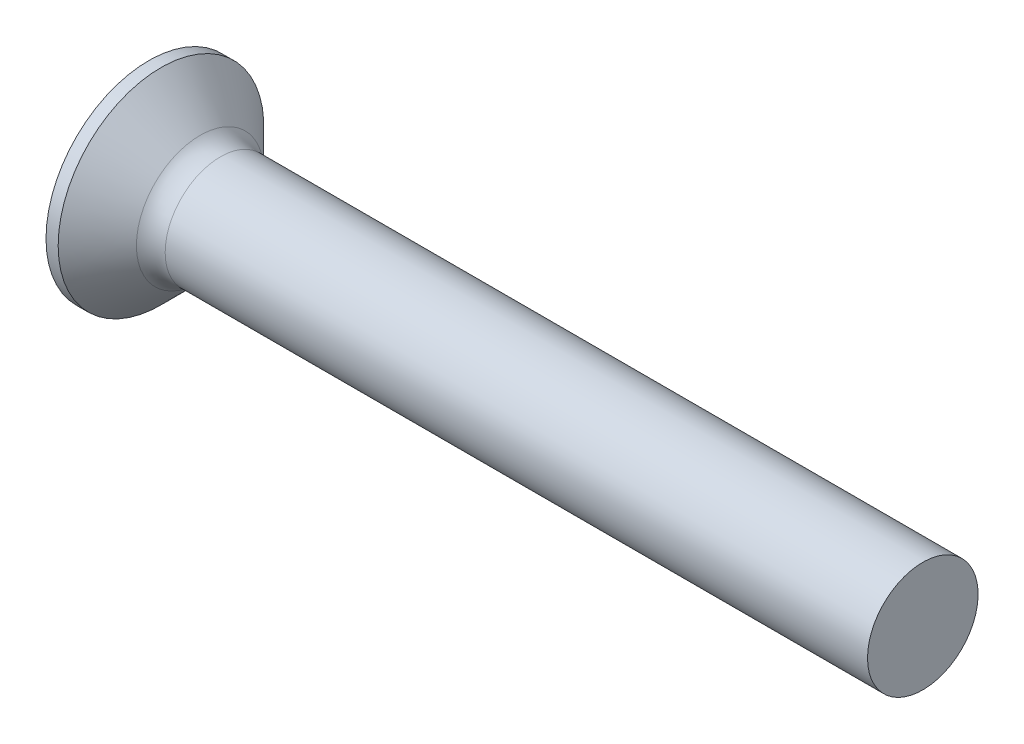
ISO-10303-21;
HEADER;
FILE_DESCRIPTION(('STEP AP214'),'2;1');
FILE_NAME('part.step','',(''),(''),'','','');
FILE_SCHEMA(('AUTOMOTIVE_DESIGN { 1 0 10303 214 1 1 1 1 }'));
ENDSEC;
DATA;
#1=APPLICATION_CONTEXT('core data for automotive mechanical design processes');
#2=APPLICATION_PROTOCOL_DEFINITION('international standard','automotive_design',2000,#1);
#3=PRODUCT_CONTEXT('',#1,'mechanical');
#4=PRODUCT('Part','Part','',(#3));
#5=PRODUCT_RELATED_PRODUCT_CATEGORY('part','',(#4));
#6=PRODUCT_DEFINITION_FORMATION('','',#4);
#7=PRODUCT_DEFINITION_CONTEXT('part definition',#1,'design');
#8=PRODUCT_DEFINITION('design','',#6,#7);
#9=PRODUCT_DEFINITION_SHAPE('','',#8);
#10=(LENGTH_UNIT() NAMED_UNIT(*) SI_UNIT(.MILLI.,.METRE.));
#11=(NAMED_UNIT(*) PLANE_ANGLE_UNIT() SI_UNIT($,.RADIAN.));
#12=(NAMED_UNIT(*) SI_UNIT($,.STERADIAN.) SOLID_ANGLE_UNIT());
#13=UNCERTAINTY_MEASURE_WITH_UNIT(LENGTH_MEASURE(1.E-05),#10,'distance_accuracy_value','');
#14=(GEOMETRIC_REPRESENTATION_CONTEXT(3) GLOBAL_UNCERTAINTY_ASSIGNED_CONTEXT((#13)) GLOBAL_UNIT_ASSIGNED_CONTEXT((#10,
#11,#12)) REPRESENTATION_CONTEXT('',''));
#15=CARTESIAN_POINT('',(0.,0.,0.));
#16=DIRECTION('',(0.,0.,1.));
#17=DIRECTION('',(1.,0.,0.));
#18=AXIS2_PLACEMENT_3D('',#15,#16,#17);
#19=CARTESIAN_POINT('',(3.05,-0.929326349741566,0.515));
#20=DIRECTION('',(0.,0.,-1.));
#21=DIRECTION('',(0.,1.,0.));
#22=AXIS2_PLACEMENT_3D('',#19,#20,#21);
#23=PLANE('',#22);
#24=DIRECTION('',(0.,-1.,0.));
#25=VECTOR('',#24,1.);
#26=CARTESIAN_POINT('',(0.,2.45,0.515));
#27=LINE('',#26,#25);
#28=CARTESIAN_POINT('',(0.,-0.931375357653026,0.515));
#29=VERTEX_POINT('',#28);
#30=CARTESIAN_POINT('',(0.,-2.45,0.515));
#31=VERTEX_POINT('',#30);
#32=EDGE_CURVE('E313',#29,#31,#27,.T.);
#33=ORIENTED_EDGE('',*,*,#32,.F.);
#34=CARTESIAN_POINT('',(-1.54221347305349,-1.05291860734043,0.515));
#35=CARTESIAN_POINT('',(-1.22007147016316,-1.02783607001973,0.515));
#36=CARTESIAN_POINT('',(-0.89794181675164,-1.002592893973,0.515));
#37=CARTESIAN_POINT('',(-0.253713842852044,-0.951673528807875,0.515));
#38=CARTESIAN_POINT('',(0.0683844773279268,-0.925997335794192,0.515));
#39=CARTESIAN_POINT('',(0.712537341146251,-0.874100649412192,0.515));
#40=CARTESIAN_POINT('',(1.03459188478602,-0.847880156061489,0.515));
#41=CARTESIAN_POINT('',(1.67864013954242,-0.794723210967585,0.515));
#42=CARTESIAN_POINT('',(2.0006338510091,-0.767786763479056,0.515));
#43=CARTESIAN_POINT('',(2.56056239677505,-0.720091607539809,0.515));
#44=CARTESIAN_POINT('',(2.7985160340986,-0.699554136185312,0.515));
#45=CARTESIAN_POINT('',(3.27436149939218,-0.657782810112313,0.515));
#46=CARTESIAN_POINT('',(3.51225332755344,-0.636548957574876,0.515));
#47=CARTESIAN_POINT('',(3.98796007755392,-0.59316517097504,0.515));
#48=CARTESIAN_POINT('',(4.22577499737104,-0.571015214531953,0.515));
#49=CARTESIAN_POINT('',(4.70127802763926,-0.525368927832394,0.515));
#50=CARTESIAN_POINT('',(4.93896613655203,-0.50187258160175,0.515));
#51=CARTESIAN_POINT('',(5.17656597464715,-0.477487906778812,0.515));
#52=B_SPLINE_CURVE_WITH_KNOTS('',3,(#34,#35,#36,#37,#38,#39,#40,#41,#42,#43,#44,#45,#46,#47,#48,
#49,#50,#51),.UNSPECIFIED.,.F.,.F.,(4,2,2,2,2,2,2,2,4),(0.,0.969351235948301,1.93871119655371,
2.90807112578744,3.87742529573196,4.59393929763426,5.3104510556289,6.0269803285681,
6.74351810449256),.UNSPECIFIED.);
#53=CARTESIAN_POINT('',(3.05,-0.677477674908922,0.515));
#54=VERTEX_POINT('',#53);
#55=EDGE_CURVE('E193',#29,#54,#52,.T.);
#56=ORIENTED_EDGE('',*,*,#55,.T.);
#57=DIRECTION('',(0.,-1.,0.));
#58=VECTOR('',#57,1.);
#59=CARTESIAN_POINT('',(3.05,0.929326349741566,0.515));
#60=LINE('',#59,#58);
#61=CARTESIAN_POINT('',(3.05,-0.929326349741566,0.515));
#62=VERTEX_POINT('',#61);
#63=EDGE_CURVE('E337',#54,#62,#60,.T.);
#64=ORIENTED_EDGE('',*,*,#63,.T.);
#65=DIRECTION('',(0.894934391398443,0.446197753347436,0.));
#66=VECTOR('',#65,1.);
#67=CARTESIAN_POINT('',(0.,-2.45,0.515));
#68=LINE('',#67,#66);
#69=EDGE_CURVE('E324',#31,#62,#68,.T.);
#70=ORIENTED_EDGE('',*,*,#69,.F.);
#71=EDGE_LOOP('',(#33,#56,#64,#70));
#72=FACE_BOUND('',#71,.T.);
#73=ADVANCED_FACE('F35',(#72),#23,.T.);
#74=CARTESIAN_POINT('',(3.05,0.929326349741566,0.515));
#75=VERTEX_POINT('',#74);
#76=CARTESIAN_POINT('',(3.05,0.677477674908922,0.515));
#77=VERTEX_POINT('',#76);
#78=EDGE_CURVE('E339',#75,#77,#60,.T.);
#79=ORIENTED_EDGE('',*,*,#78,.T.);
#80=CARTESIAN_POINT('',(-1.54221347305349,1.05291860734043,0.515));
#81=CARTESIAN_POINT('',(-1.22007147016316,1.02783607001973,0.515));
#82=CARTESIAN_POINT('',(-0.89794181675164,1.002592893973,0.515));
#83=CARTESIAN_POINT('',(-0.253713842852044,0.951673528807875,0.515));
#84=CARTESIAN_POINT('',(0.0683844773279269,0.925997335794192,0.515));
#85=CARTESIAN_POINT('',(0.712537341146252,0.874100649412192,0.515));
#86=CARTESIAN_POINT('',(1.03459188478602,0.847880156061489,0.515));
#87=CARTESIAN_POINT('',(1.67864013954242,0.794723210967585,0.515));
#88=CARTESIAN_POINT('',(2.0006338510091,0.767786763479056,0.515));
#89=CARTESIAN_POINT('',(2.56056239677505,0.720091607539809,0.515));
#90=CARTESIAN_POINT('',(2.7985160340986,0.699554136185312,0.515));
#91=CARTESIAN_POINT('',(3.27436149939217,0.657782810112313,0.515));
#92=CARTESIAN_POINT('',(3.51225332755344,0.636548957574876,0.515));
#93=CARTESIAN_POINT('',(3.98796007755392,0.59316517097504,0.515));
#94=CARTESIAN_POINT('',(4.22577499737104,0.571015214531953,0.515));
#95=CARTESIAN_POINT('',(4.70127802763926,0.525368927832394,0.515));
#96=CARTESIAN_POINT('',(4.93896613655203,0.50187258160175,0.515));
#97=CARTESIAN_POINT('',(5.17656597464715,0.477487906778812,0.515));
#98=B_SPLINE_CURVE_WITH_KNOTS('',3,(#80,#81,#82,#83,#84,#85,#86,#87,#88,#89,#90,#91,#92,#93,#94,
#95,#96,#97),.UNSPECIFIED.,.F.,.F.,(4,2,2,2,2,2,2,2,4),(0.,0.969351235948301,1.93871119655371,
2.90807112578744,3.87742529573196,4.59393929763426,5.3104510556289,6.0269803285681,
6.74351810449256),.UNSPECIFIED.);
#99=CARTESIAN_POINT('',(0.,0.931375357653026,0.515));
#100=VERTEX_POINT('',#99);
#101=EDGE_CURVE('E186',#77,#100,#98,.F.);
#102=ORIENTED_EDGE('',*,*,#101,.T.);
#103=CARTESIAN_POINT('',(0.,2.45,0.515));
#104=VERTEX_POINT('',#103);
#105=EDGE_CURVE('E315',#104,#100,#27,.T.);
#106=ORIENTED_EDGE('',*,*,#105,.F.);
#107=DIRECTION('',(0.894934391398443,-0.446197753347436,0.));
#108=VECTOR('',#107,1.);
#109=CARTESIAN_POINT('',(0.,2.45,0.515));
#110=LINE('',#109,#108);
#111=EDGE_CURVE('E64',#104,#75,#110,.T.);
#112=ORIENTED_EDGE('',*,*,#111,.T.);
#113=EDGE_LOOP('',(#79,#102,#106,#112));
#114=FACE_BOUND('',#113,.T.);
#115=ADVANCED_FACE('F168',(#114),#23,.T.);
#116=CARTESIAN_POINT('',(3.05,0.929326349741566,-0.515));
#117=DIRECTION('',(0.,0.,1.));
#118=DIRECTION('',(1.,0.,0.));
#119=AXIS2_PLACEMENT_3D('',#116,#117,#118);
#120=PLANE('',#119);
#121=DIRECTION('',(0.,1.,0.));
#122=VECTOR('',#121,1.);
#123=CARTESIAN_POINT('',(3.05,-0.929326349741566,-0.515));
#124=LINE('',#123,#122);
#125=CARTESIAN_POINT('',(3.05,-0.929326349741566,-0.515));
#126=VERTEX_POINT('',#125);
#127=CARTESIAN_POINT('',(3.05,-0.677477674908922,-0.515));
#128=VERTEX_POINT('',#127);
#129=EDGE_CURVE('E338',#126,#128,#124,.T.);
#130=ORIENTED_EDGE('',*,*,#129,.T.);
#131=CARTESIAN_POINT('',(-1.54221347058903,-1.05291860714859,-0.515));
#132=CARTESIAN_POINT('',(-1.22007146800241,-1.02783606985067,-0.515));
#133=CARTESIAN_POINT('',(-0.897941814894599,-1.00259289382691,-0.515));
#134=CARTESIAN_POINT('',(-0.253713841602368,-0.951673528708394,-0.515));
#135=CARTESIAN_POINT('',(0.0683844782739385,-0.925997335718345,-0.515));
#136=CARTESIAN_POINT('',(0.712537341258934,-0.874100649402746,-0.515));
#137=CARTESIAN_POINT('',(1.03459188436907,-0.847880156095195,-0.515));
#138=CARTESIAN_POINT('',(1.67864013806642,-0.794723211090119,-0.515));
#139=CARTESIAN_POINT('',(2.00063384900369,-0.767786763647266,-0.515));
#140=CARTESIAN_POINT('',(2.56056239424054,-0.720091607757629,-0.515));
#141=CARTESIAN_POINT('',(2.79851603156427,-0.699554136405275,-0.515));
#142=CARTESIAN_POINT('',(3.27436149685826,-0.657782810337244,-0.515));
#143=CARTESIAN_POINT('',(3.51225332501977,-0.636548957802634,-0.515));
#144=CARTESIAN_POINT('',(3.98796007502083,-0.593165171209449,-0.515));
#145=CARTESIAN_POINT('',(4.22577499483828,-0.571015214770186,-0.515));
#146=CARTESIAN_POINT('',(4.70127802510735,-0.525368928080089,-0.515));
#147=CARTESIAN_POINT('',(4.93896613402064,-0.501872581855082,-0.515));
#148=CARTESIAN_POINT('',(5.17656597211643,-0.477487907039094,-0.515));
#149=B_SPLINE_CURVE_WITH_KNOTS('',3,(#131,#132,#133,#134,#135,#136,#137,#138,#139,#140,#141,
#142,#143,#144,#145,#146,#147,#148),.UNSPECIFIED.,.F.,.F.,(4,2,2,2,2,2,2,2,4),(0.,
0.9693512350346,1.93871119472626,2.90807112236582,3.87742529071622,4.59393929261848,
5.3104510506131,6.02698032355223,6.74351809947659),.UNSPECIFIED.);
#150=CARTESIAN_POINT('',(0.,-0.931375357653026,-0.515));
#151=VERTEX_POINT('',#150);
#152=EDGE_CURVE('E239',#128,#151,#149,.F.);
#153=ORIENTED_EDGE('',*,*,#152,.T.);
#154=DIRECTION('',(0.,1.,0.));
#155=VECTOR('',#154,1.);
#156=CARTESIAN_POINT('',(0.,-2.45,-0.515));
#157=LINE('',#156,#155);
#158=CARTESIAN_POINT('',(0.,-2.45,-0.515));
#159=VERTEX_POINT('',#158);
#160=EDGE_CURVE('E314',#159,#151,#157,.T.);
#161=ORIENTED_EDGE('',*,*,#160,.F.);
#162=DIRECTION('',(0.894934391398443,0.446197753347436,0.));
#163=VECTOR('',#162,1.);
#164=CARTESIAN_POINT('',(0.,-2.45,-0.515));
#165=LINE('',#164,#163);
#166=EDGE_CURVE('E327',#159,#126,#165,.T.);
#167=ORIENTED_EDGE('',*,*,#166,.T.);
#168=EDGE_LOOP('',(#130,#153,#161,#167));
#169=FACE_BOUND('',#168,.T.);
#170=ADVANCED_FACE('F174',(#169),#120,.T.);
#171=CARTESIAN_POINT('',(0.,0.931375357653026,-0.515));
#172=VERTEX_POINT('',#171);
#173=CARTESIAN_POINT('',(0.,2.45,-0.515));
#174=VERTEX_POINT('',#173);
#175=EDGE_CURVE('E323',#172,#174,#157,.T.);
#176=ORIENTED_EDGE('',*,*,#175,.F.);
#177=CARTESIAN_POINT('',(-1.54221347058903,1.05291860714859,-0.515));
#178=CARTESIAN_POINT('',(-1.22007146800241,1.02783606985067,-0.515));
#179=CARTESIAN_POINT('',(-0.897941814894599,1.00259289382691,-0.515));
#180=CARTESIAN_POINT('',(-0.253713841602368,0.951673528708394,-0.515));
#181=CARTESIAN_POINT('',(0.0683844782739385,0.925997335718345,-0.515));
#182=CARTESIAN_POINT('',(0.712537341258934,0.874100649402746,-0.515));
#183=CARTESIAN_POINT('',(1.03459188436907,0.847880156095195,-0.515));
#184=CARTESIAN_POINT('',(1.67864013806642,0.794723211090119,-0.515));
#185=CARTESIAN_POINT('',(2.00063384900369,0.767786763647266,-0.515));
#186=CARTESIAN_POINT('',(2.56056239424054,0.720091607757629,-0.515));
#187=CARTESIAN_POINT('',(2.79851603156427,0.699554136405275,-0.515));
#188=CARTESIAN_POINT('',(3.27436149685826,0.657782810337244,-0.515));
#189=CARTESIAN_POINT('',(3.51225332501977,0.636548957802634,-0.515));
#190=CARTESIAN_POINT('',(3.98796007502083,0.593165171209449,-0.515));
#191=CARTESIAN_POINT('',(4.22577499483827,0.571015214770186,-0.515));
#192=CARTESIAN_POINT('',(4.70127802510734,0.525368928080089,-0.515));
#193=CARTESIAN_POINT('',(4.93896613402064,0.501872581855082,-0.515));
#194=CARTESIAN_POINT('',(5.17656597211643,0.477487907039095,-0.515));
#195=B_SPLINE_CURVE_WITH_KNOTS('',3,(#177,#178,#179,#180,#181,#182,#183,#184,#185,#186,#187,
#188,#189,#190,#191,#192,#193,#194),.UNSPECIFIED.,.F.,.F.,(4,2,2,2,2,2,2,2,4),(0.,
0.9693512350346,1.93871119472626,2.90807112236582,3.87742529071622,4.59393929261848,
5.3104510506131,6.02698032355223,6.74351809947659),.UNSPECIFIED.);
#196=CARTESIAN_POINT('',(3.05,0.677477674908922,-0.515));
#197=VERTEX_POINT('',#196);
#198=EDGE_CURVE('E234',#172,#197,#195,.T.);
#199=ORIENTED_EDGE('',*,*,#198,.T.);
#200=CARTESIAN_POINT('',(3.05,0.929326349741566,-0.515));
#201=VERTEX_POINT('',#200);
#202=EDGE_CURVE('E344',#197,#201,#124,.T.);
#203=ORIENTED_EDGE('',*,*,#202,.T.);
#204=DIRECTION('',(0.894934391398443,-0.446197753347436,0.));
#205=VECTOR('',#204,1.);
#206=CARTESIAN_POINT('',(0.,2.45,-0.515));
#207=LINE('',#206,#205);
#208=EDGE_CURVE('E331',#174,#201,#207,.T.);
#209=ORIENTED_EDGE('',*,*,#208,.F.);
#210=EDGE_LOOP('',(#176,#199,#203,#209));
#211=FACE_BOUND('',#210,.T.);
#212=ADVANCED_FACE('F460',(#211),#120,.T.);
#213=CARTESIAN_POINT('',(3.05,0.929326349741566,-0.515));
#214=DIRECTION('',(1.,0.,0.));
#215=DIRECTION('',(0.,0.,-1.));
#216=AXIS2_PLACEMENT_3D('',#213,#214,#215);
#217=PLANE('',#216);
#218=CARTESIAN_POINT('',(3.05,0.,0.));
#219=DIRECTION('',(-1.,0.,0.));
#220=DIRECTION('',(0.,0.,1.));
#221=AXIS2_PLACEMENT_3D('',#218,#219,#220);
#222=CIRCLE('',#221,0.850999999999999);
#223=EDGE_CURVE('E283',#128,#54,#222,.T.);
#224=ORIENTED_EDGE('',*,*,#223,.F.);
#225=ORIENTED_EDGE('',*,*,#129,.F.);
#226=DIRECTION('',(0.,0.,-1.));
#227=VECTOR('',#226,1.);
#228=CARTESIAN_POINT('',(3.05,-0.929326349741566,0.515));
#229=LINE('',#228,#227);
#230=EDGE_CURVE('E334',#62,#126,#229,.T.);
#231=ORIENTED_EDGE('',*,*,#230,.F.);
#232=ORIENTED_EDGE('',*,*,#63,.F.);
#233=EDGE_LOOP('',(#224,#225,#231,#232));
#234=FACE_BOUND('',#233,.T.);
#235=ADVANCED_FACE('F417',(#234),#217,.F.);
#236=CARTESIAN_POINT('',(3.05,-0.515000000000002,0.67747767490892));
#237=VERTEX_POINT('',#236);
#238=CARTESIAN_POINT('',(3.05,0.514999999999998,0.677477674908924));
#239=VERTEX_POINT('',#238);
#240=EDGE_CURVE('E276',#237,#239,#222,.T.);
#241=ORIENTED_EDGE('',*,*,#240,.F.);
#242=DIRECTION('',(0.,0.,-1.));
#243=VECTOR('',#242,1.);
#244=CARTESIAN_POINT('',(3.05,-0.515000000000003,0.929326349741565));
#245=LINE('',#244,#243);
#246=CARTESIAN_POINT('',(3.05,-0.515000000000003,0.929326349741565));
#247=VERTEX_POINT('',#246);
#248=EDGE_CURVE('E402',#247,#237,#245,.T.);
#249=ORIENTED_EDGE('',*,*,#248,.F.);
#250=DIRECTION('',(0.,-1.,0.));
#251=VECTOR('',#250,1.);
#252=CARTESIAN_POINT('',(3.05,0.514999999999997,0.929326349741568));
#253=LINE('',#252,#251);
#254=CARTESIAN_POINT('',(3.05,0.514999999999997,0.929326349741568));
#255=VERTEX_POINT('',#254);
#256=EDGE_CURVE('E302',#255,#247,#253,.T.);
#257=ORIENTED_EDGE('',*,*,#256,.F.);
#258=DIRECTION('',(0.,0.,1.));
#259=VECTOR('',#258,1.);
#260=CARTESIAN_POINT('',(3.05,0.515000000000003,-0.929326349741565));
#261=LINE('',#260,#259);
#262=EDGE_CURVE('E200',#239,#255,#261,.T.);
#263=ORIENTED_EDGE('',*,*,#262,.F.);
#264=EDGE_LOOP('',(#241,#249,#257,#263));
#265=FACE_BOUND('',#264,.T.);
#266=ADVANCED_FACE('F452',(#265),#217,.F.);
#267=EDGE_CURVE('E275',#77,#197,#222,.T.);
#268=ORIENTED_EDGE('',*,*,#267,.F.);
#269=ORIENTED_EDGE('',*,*,#78,.F.);
#270=DIRECTION('',(0.,0.,1.));
#271=VECTOR('',#270,1.);
#272=CARTESIAN_POINT('',(3.05,0.929326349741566,-0.515));
#273=LINE('',#272,#271);
#274=EDGE_CURVE('E335',#201,#75,#273,.T.);
#275=ORIENTED_EDGE('',*,*,#274,.F.);
#276=ORIENTED_EDGE('',*,*,#202,.F.);
#277=EDGE_LOOP('',(#268,#269,#275,#276));
#278=FACE_BOUND('',#277,.T.);
#279=ADVANCED_FACE('F432',(#278),#217,.F.);
#280=CARTESIAN_POINT('',(3.05,0.514999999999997,0.929326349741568));
#281=DIRECTION('',(0.,-1.,0.));
#282=DIRECTION('',(1.,0.,0.));
#283=AXIS2_PLACEMENT_3D('',#280,#281,#282);
#284=PLANE('',#283);
#285=CARTESIAN_POINT('',(3.05,0.515000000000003,-0.929326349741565));
#286=VERTEX_POINT('',#285);
#287=CARTESIAN_POINT('',(3.05,0.515000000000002,-0.67747767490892));
#288=VERTEX_POINT('',#287);
#289=EDGE_CURVE('E297',#286,#288,#261,.T.);
#290=ORIENTED_EDGE('',*,*,#289,.T.);
#291=CARTESIAN_POINT('',(-1.54221347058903,0.515000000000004,-1.05291860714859));
#292=CARTESIAN_POINT('',(-1.22007146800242,0.515000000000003,-1.02783606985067));
#293=CARTESIAN_POINT('',(-0.897941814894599,0.515000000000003,-1.00259289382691));
#294=CARTESIAN_POINT('',(-0.253713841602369,0.515000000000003,-0.951673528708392));
#295=CARTESIAN_POINT('',(0.0683844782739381,0.515000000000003,-0.925997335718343));
#296=CARTESIAN_POINT('',(0.712537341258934,0.515000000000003,-0.874100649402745));
#297=CARTESIAN_POINT('',(1.03459188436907,0.515000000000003,-0.847880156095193));
#298=CARTESIAN_POINT('',(1.67864013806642,0.515000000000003,-0.794723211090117));
#299=CARTESIAN_POINT('',(2.00063384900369,0.515000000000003,-0.767786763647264));
#300=CARTESIAN_POINT('',(2.56056239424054,0.515000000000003,-0.720091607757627));
#301=CARTESIAN_POINT('',(2.79851603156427,0.515000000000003,-0.699554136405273));
#302=CARTESIAN_POINT('',(3.27436149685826,0.515000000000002,-0.657782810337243));
#303=CARTESIAN_POINT('',(3.51225332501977,0.515000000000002,-0.636548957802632));
#304=CARTESIAN_POINT('',(3.98796007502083,0.515000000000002,-0.593165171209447));
#305=CARTESIAN_POINT('',(4.22577499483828,0.515000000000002,-0.571015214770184));
#306=CARTESIAN_POINT('',(4.70127802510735,0.515000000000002,-0.525368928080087));
#307=CARTESIAN_POINT('',(4.93896613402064,0.515000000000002,-0.50187258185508));
#308=CARTESIAN_POINT('',(5.17656597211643,0.515000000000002,-0.477487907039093));
#309=B_SPLINE_CURVE_WITH_KNOTS('',3,(#291,#292,#293,#294,#295,#296,#297,#298,#299,#300,#301,
#302,#303,#304,#305,#306,#307,#308),.UNSPECIFIED.,.F.,.F.,(4,2,2,2,2,2,2,2,4),(0.,
0.969351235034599,1.93871119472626,2.90807112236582,3.87742529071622,4.59393929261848,
5.3104510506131,6.02698032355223,6.74351809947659),.UNSPECIFIED.);
#310=CARTESIAN_POINT('',(0.,0.515000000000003,-0.931375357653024));
#311=VERTEX_POINT('',#310);
#312=EDGE_CURVE('E227',#288,#311,#309,.F.);
#313=ORIENTED_EDGE('',*,*,#312,.T.);
#314=DIRECTION('',(0.,0.,1.));
#315=VECTOR('',#314,1.);
#316=CARTESIAN_POINT('',(0.,0.515000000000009,-2.45));
#317=LINE('',#316,#315);
#318=CARTESIAN_POINT('',(0.,0.515000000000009,-2.45));
#319=VERTEX_POINT('',#318);
#320=EDGE_CURVE('E391',#319,#311,#317,.T.);
#321=ORIENTED_EDGE('',*,*,#320,.F.);
#322=DIRECTION('',(0.894934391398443,0.,0.446197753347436));
#323=VECTOR('',#322,1.);
#324=CARTESIAN_POINT('',(0.,0.515000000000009,-2.45));
#325=LINE('',#324,#323);
#326=EDGE_CURVE('E301',#319,#286,#325,.T.);
#327=ORIENTED_EDGE('',*,*,#326,.T.);
#328=EDGE_LOOP('',(#290,#313,#321,#327));
#329=FACE_BOUND('',#328,.T.);
#330=ADVANCED_FACE('F300',(#329),#284,.T.);
#331=CARTESIAN_POINT('',(3.05,-0.514999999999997,-0.929326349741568));
#332=DIRECTION('',(0.,1.,0.));
#333=DIRECTION('',(0.,0.,1.));
#334=AXIS2_PLACEMENT_3D('',#331,#332,#333);
#335=PLANE('',#334);
#336=DIRECTION('',(0.,0.,-1.));
#337=VECTOR('',#336,1.);
#338=CARTESIAN_POINT('',(0.,-0.515000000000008,2.45));
#339=LINE('',#338,#337);
#340=CARTESIAN_POINT('',(0.,-0.514999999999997,-0.931375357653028));
#341=VERTEX_POINT('',#340);
#342=CARTESIAN_POINT('',(0.,-0.514999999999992,-2.45));
#343=VERTEX_POINT('',#342);
#344=EDGE_CURVE('E387',#341,#343,#339,.T.);
#345=ORIENTED_EDGE('',*,*,#344,.F.);
#346=CARTESIAN_POINT('',(-1.54221347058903,-0.514999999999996,-1.05291860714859));
#347=CARTESIAN_POINT('',(-1.22007146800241,-0.514999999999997,-1.02783606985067));
#348=CARTESIAN_POINT('',(-0.897941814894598,-0.514999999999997,-1.00259289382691));
#349=CARTESIAN_POINT('',(-0.253713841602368,-0.514999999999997,-0.951673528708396));
#350=CARTESIAN_POINT('',(0.0683844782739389,-0.514999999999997,-0.925997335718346));
#351=CARTESIAN_POINT('',(0.712537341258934,-0.514999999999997,-0.874100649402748));
#352=CARTESIAN_POINT('',(1.03459188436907,-0.514999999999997,-0.847880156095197));
#353=CARTESIAN_POINT('',(1.67864013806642,-0.514999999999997,-0.794723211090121));
#354=CARTESIAN_POINT('',(2.00063384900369,-0.514999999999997,-0.767786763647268));
#355=CARTESIAN_POINT('',(2.56056239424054,-0.514999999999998,-0.72009160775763));
#356=CARTESIAN_POINT('',(2.79851603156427,-0.514999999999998,-0.699554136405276));
#357=CARTESIAN_POINT('',(3.27436149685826,-0.514999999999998,-0.657782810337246));
#358=CARTESIAN_POINT('',(3.51225332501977,-0.514999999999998,-0.636548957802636));
#359=CARTESIAN_POINT('',(3.98796007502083,-0.514999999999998,-0.59316517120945));
#360=CARTESIAN_POINT('',(4.22577499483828,-0.514999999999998,-0.571015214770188));
#361=CARTESIAN_POINT('',(4.70127802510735,-0.514999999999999,-0.52536892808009));
#362=CARTESIAN_POINT('',(4.93896613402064,-0.514999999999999,-0.501872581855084));
#363=CARTESIAN_POINT('',(5.17656597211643,-0.514999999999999,-0.477487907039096));
#364=B_SPLINE_CURVE_WITH_KNOTS('',3,(#346,#347,#348,#349,#350,#351,#352,#353,#354,#355,#356,
#357,#358,#359,#360,#361,#362,#363),.UNSPECIFIED.,.F.,.F.,(4,2,2,2,2,2,2,2,4),(0.,
0.969351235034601,1.93871119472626,2.90807112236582,3.87742529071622,4.59393929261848,
5.3104510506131,6.02698032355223,6.74351809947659),.UNSPECIFIED.);
#365=CARTESIAN_POINT('',(3.05,-0.514999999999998,-0.677477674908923));
#366=VERTEX_POINT('',#365);
#367=EDGE_CURVE('E220',#341,#366,#364,.T.);
#368=ORIENTED_EDGE('',*,*,#367,.T.);
#369=CARTESIAN_POINT('',(3.05,-0.514999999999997,-0.929326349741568));
#370=VERTEX_POINT('',#369);
#371=EDGE_CURVE('E299',#366,#370,#245,.T.);
#372=ORIENTED_EDGE('',*,*,#371,.T.);
#373=DIRECTION('',(0.894934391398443,0.,0.446197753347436));
#374=VECTOR('',#373,1.);
#375=CARTESIAN_POINT('',(0.,-0.514999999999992,-2.45));
#376=LINE('',#375,#374);
#377=EDGE_CURVE('E394',#343,#370,#376,.T.);
#378=ORIENTED_EDGE('',*,*,#377,.F.);
#379=EDGE_LOOP('',(#345,#368,#372,#378));
#380=FACE_BOUND('',#379,.T.);
#381=ADVANCED_FACE('F405',(#380),#335,.T.);
#382=ORIENTED_EDGE('',*,*,#248,.T.);
#383=CARTESIAN_POINT('',(-1.54221347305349,-0.515000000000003,1.05291860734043));
#384=CARTESIAN_POINT('',(-1.22007147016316,-0.515000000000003,1.02783607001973));
#385=CARTESIAN_POINT('',(-0.89794181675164,-0.515000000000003,1.002592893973));
#386=CARTESIAN_POINT('',(-0.253713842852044,-0.515000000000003,0.951673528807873));
#387=CARTESIAN_POINT('',(0.0683844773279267,-0.515000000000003,0.92599733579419));
#388=CARTESIAN_POINT('',(0.712537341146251,-0.515000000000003,0.87410064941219));
#389=CARTESIAN_POINT('',(1.03459188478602,-0.515000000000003,0.847880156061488));
#390=CARTESIAN_POINT('',(1.67864013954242,-0.515000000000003,0.794723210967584));
#391=CARTESIAN_POINT('',(2.0006338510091,-0.515000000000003,0.767786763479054));
#392=CARTESIAN_POINT('',(2.56056239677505,-0.515000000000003,0.720091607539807));
#393=CARTESIAN_POINT('',(2.7985160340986,-0.515000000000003,0.69955413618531));
#394=CARTESIAN_POINT('',(3.27436149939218,-0.515000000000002,0.657782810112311));
#395=CARTESIAN_POINT('',(3.51225332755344,-0.515000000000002,0.636548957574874));
#396=CARTESIAN_POINT('',(3.98796007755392,-0.515000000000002,0.593165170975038));
#397=CARTESIAN_POINT('',(4.22577499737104,-0.515000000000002,0.571015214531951));
#398=CARTESIAN_POINT('',(4.70127802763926,-0.515000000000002,0.525368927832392));
#399=CARTESIAN_POINT('',(4.93896613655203,-0.515000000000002,0.501872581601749));
#400=CARTESIAN_POINT('',(5.17656597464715,-0.515000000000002,0.47748790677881));
#401=B_SPLINE_CURVE_WITH_KNOTS('',3,(#383,#384,#385,#386,#387,#388,#389,#390,#391,#392,#393,
#394,#395,#396,#397,#398,#399,#400),.UNSPECIFIED.,.F.,.F.,(4,2,2,2,2,2,2,2,4),(0.,
0.969351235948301,1.93871119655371,2.90807112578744,3.87742529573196,4.59393929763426,
5.3104510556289,6.0269803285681,6.74351810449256),.UNSPECIFIED.);
#402=CARTESIAN_POINT('',(0.,-0.515000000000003,0.931375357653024));
#403=VERTEX_POINT('',#402);
#404=EDGE_CURVE('E212',#237,#403,#401,.F.);
#405=ORIENTED_EDGE('',*,*,#404,.T.);
#406=CARTESIAN_POINT('',(0.,-0.515000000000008,2.45));
#407=VERTEX_POINT('',#406);
#408=EDGE_CURVE('E383',#407,#403,#339,.T.);
#409=ORIENTED_EDGE('',*,*,#408,.F.);
#410=DIRECTION('',(0.894934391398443,0.,-0.446197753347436));
#411=VECTOR('',#410,1.);
#412=CARTESIAN_POINT('',(0.,-0.515000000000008,2.45));
#413=LINE('',#412,#411);
#414=EDGE_CURVE('E398',#407,#247,#413,.T.);
#415=ORIENTED_EDGE('',*,*,#414,.T.);
#416=EDGE_LOOP('',(#382,#405,#409,#415));
#417=FACE_BOUND('',#416,.T.);
#418=ADVANCED_FACE('F436',(#417),#335,.T.);
#419=CARTESIAN_POINT('',(0.,0.514999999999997,0.931375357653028));
#420=VERTEX_POINT('',#419);
#421=CARTESIAN_POINT('',(0.,0.514999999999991,2.45));
#422=VERTEX_POINT('',#421);
#423=EDGE_CURVE('E393',#420,#422,#317,.T.);
#424=ORIENTED_EDGE('',*,*,#423,.F.);
#425=CARTESIAN_POINT('',(-1.54221347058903,0.514999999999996,1.05291860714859));
#426=CARTESIAN_POINT('',(-1.22007146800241,0.514999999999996,1.02783606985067));
#427=CARTESIAN_POINT('',(-0.897941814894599,0.514999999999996,1.00259289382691));
#428=CARTESIAN_POINT('',(-0.253713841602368,0.514999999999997,0.951673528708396));
#429=CARTESIAN_POINT('',(0.0683844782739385,0.514999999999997,0.925997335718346));
#430=CARTESIAN_POINT('',(0.712537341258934,0.514999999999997,0.874100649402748));
#431=CARTESIAN_POINT('',(1.03459188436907,0.514999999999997,0.847880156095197));
#432=CARTESIAN_POINT('',(1.67864013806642,0.514999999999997,0.794723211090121));
#433=CARTESIAN_POINT('',(2.00063384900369,0.514999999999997,0.767786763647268));
#434=CARTESIAN_POINT('',(2.56056239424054,0.514999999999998,0.720091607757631));
#435=CARTESIAN_POINT('',(2.79851603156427,0.514999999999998,0.699554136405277));
#436=CARTESIAN_POINT('',(3.27436149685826,0.514999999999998,0.657782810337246));
#437=CARTESIAN_POINT('',(3.51225332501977,0.514999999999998,0.636548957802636));
#438=CARTESIAN_POINT('',(3.98796007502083,0.514999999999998,0.593165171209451));
#439=CARTESIAN_POINT('',(4.22577499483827,0.514999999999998,0.571015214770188));
#440=CARTESIAN_POINT('',(4.70127802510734,0.514999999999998,0.525368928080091));
#441=CARTESIAN_POINT('',(4.93896613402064,0.514999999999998,0.501872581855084));
#442=CARTESIAN_POINT('',(5.17656597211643,0.514999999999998,0.477487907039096));
#443=B_SPLINE_CURVE_WITH_KNOTS('',3,(#425,#426,#427,#428,#429,#430,#431,#432,#433,#434,#435,
#436,#437,#438,#439,#440,#441,#442),.UNSPECIFIED.,.F.,.F.,(4,2,2,2,2,2,2,2,4),(0.,
0.9693512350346,1.93871119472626,2.90807112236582,3.87742529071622,4.59393929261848,
5.3104510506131,6.02698032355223,6.74351809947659),.UNSPECIFIED.);
#444=EDGE_CURVE('E11',#420,#239,#443,.T.);
#445=ORIENTED_EDGE('',*,*,#444,.T.);
#446=ORIENTED_EDGE('',*,*,#262,.T.);
#447=DIRECTION('',(0.894934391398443,0.,-0.446197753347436));
#448=VECTOR('',#447,1.);
#449=CARTESIAN_POINT('',(0.,0.514999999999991,2.45));
#450=LINE('',#449,#448);
#451=EDGE_CURVE('E400',#422,#255,#450,.T.);
#452=ORIENTED_EDGE('',*,*,#451,.F.);
#453=EDGE_LOOP('',(#424,#445,#446,#452));
#454=FACE_BOUND('',#453,.T.);
#455=ADVANCED_FACE('F381',(#454),#284,.T.);
#456=CARTESIAN_POINT('',(0.,0.,0.));
#457=DIRECTION('',(-1.,0.,0.));
#458=DIRECTION('',(0.,0.,1.));
#459=AXIS2_PLACEMENT_3D('',#456,#457,#458);
#460=PLANE('',#459);
#461=CARTESIAN_POINT('',(0.,0.,0.));
#462=DIRECTION('',(-1.,0.,0.));
#463=DIRECTION('',(0.,0.,1.));
#464=AXIS2_PLACEMENT_3D('',#461,#462,#463);
#465=CIRCLE('',#464,4.65);
#466=CARTESIAN_POINT('',(0.,0.,4.65));
#467=VERTEX_POINT('',#466);
#468=EDGE_CURVE('E350',#467,#467,#465,.T.);
#469=ORIENTED_EDGE('',*,*,#468,.T.);
#470=EDGE_LOOP('',(#469));
#471=FACE_BOUND('',#470,.T.);
#472=ORIENTED_EDGE('',*,*,#408,.T.);
#473=CARTESIAN_POINT('',(0.,0.,0.));
#474=DIRECTION('',(-1.,0.,0.));
#475=DIRECTION('',(0.,0.,1.));
#476=AXIS2_PLACEMENT_3D('',#473,#474,#475);
#477=CIRCLE('',#476,1.06427677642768);
#478=EDGE_CURVE('E269',#29,#403,#477,.T.);
#479=ORIENTED_EDGE('',*,*,#478,.F.);
#480=ORIENTED_EDGE('',*,*,#32,.T.);
#481=DIRECTION('',(0.,0.,-1.));
#482=VECTOR('',#481,1.);
#483=CARTESIAN_POINT('',(0.,-2.45,0.515));
#484=LINE('',#483,#482);
#485=EDGE_CURVE('E318',#31,#159,#484,.T.);
#486=ORIENTED_EDGE('',*,*,#485,.T.);
#487=ORIENTED_EDGE('',*,*,#160,.T.);
#488=EDGE_CURVE('E271',#341,#151,#477,.T.);
#489=ORIENTED_EDGE('',*,*,#488,.F.);
#490=ORIENTED_EDGE('',*,*,#344,.T.);
#491=DIRECTION('',(0.,1.,0.));
#492=VECTOR('',#491,1.);
#493=CARTESIAN_POINT('',(0.,-0.514999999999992,-2.45));
#494=LINE('',#493,#492);
#495=EDGE_CURVE('E386',#343,#319,#494,.T.);
#496=ORIENTED_EDGE('',*,*,#495,.T.);
#497=ORIENTED_EDGE('',*,*,#320,.T.);
#498=EDGE_CURVE('E268',#172,#311,#477,.T.);
#499=ORIENTED_EDGE('',*,*,#498,.F.);
#500=ORIENTED_EDGE('',*,*,#175,.T.);
#501=DIRECTION('',(0.,0.,1.));
#502=VECTOR('',#501,1.);
#503=CARTESIAN_POINT('',(0.,2.45,-0.515));
#504=LINE('',#503,#502);
#505=EDGE_CURVE('E310',#174,#104,#504,.T.);
#506=ORIENTED_EDGE('',*,*,#505,.T.);
#507=ORIENTED_EDGE('',*,*,#105,.T.);
#508=EDGE_CURVE('E264',#420,#100,#477,.T.);
#509=ORIENTED_EDGE('',*,*,#508,.F.);
#510=ORIENTED_EDGE('',*,*,#423,.T.);
#511=DIRECTION('',(0.,-1.,0.));
#512=VECTOR('',#511,1.);
#513=CARTESIAN_POINT('',(0.,0.514999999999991,2.45));
#514=LINE('',#513,#512);
#515=EDGE_CURVE('E201',#422,#407,#514,.T.);
#516=ORIENTED_EDGE('',*,*,#515,.T.);
#517=EDGE_LOOP('',(#472,#479,#480,#486,#487,#489,#490,#496,#497,#499,#500,#506,#507,#509,#510,#516));
#518=FACE_BOUND('',#517,.T.);
#519=ADVANCED_FACE('F375',(#471,#518),#460,.T.);
#520=CARTESIAN_POINT('',(-6.34999999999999,0.,0.));
#521=DIRECTION('',(-1.,0.,0.));
#522=DIRECTION('',(0.,0.,1.));
#523=AXIS2_PLACEMENT_3D('',#520,#521,#522);
#524=CYLINDRICAL_SURFACE('',#523,4.65);
#525=CARTESIAN_POINT('',(0.550000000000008,0.,0.));
#526=DIRECTION('',(-1.,0.,0.));
#527=DIRECTION('',(0.,0.,1.));
#528=AXIS2_PLACEMENT_3D('',#525,#526,#527);
#529=CIRCLE('',#528,4.65);
#530=CARTESIAN_POINT('',(0.550000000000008,0.,4.65));
#531=VERTEX_POINT('',#530);
#532=EDGE_CURVE('E347',#531,#531,#529,.T.);
#533=ORIENTED_EDGE('',*,*,#532,.T.);
#534=EDGE_LOOP('',(#533));
#535=FACE_BOUND('',#534,.T.);
#536=ORIENTED_EDGE('',*,*,#468,.F.);
#537=EDGE_LOOP('',(#536));
#538=FACE_BOUND('',#537,.T.);
#539=ADVANCED_FACE('F369',(#535,#538),#524,.T.);
#540=CARTESIAN_POINT('',(0.550000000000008,0.,0.));
#541=DIRECTION('',(-1.,0.,0.));
#542=DIRECTION('',(0.,0.,1.));
#543=AXIS2_PLACEMENT_3D('',#540,#541,#542);
#544=CONICAL_SURFACE('',#543,4.65,0.78539816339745);
#545=CARTESIAN_POINT('',(2.31923881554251,0.,0.));
#546=DIRECTION('',(-1.,0.,0.));
#547=DIRECTION('',(0.,0.,1.));
#548=AXIS2_PLACEMENT_3D('',#545,#546,#547);
#549=CIRCLE('',#548,2.88076118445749);
#550=CARTESIAN_POINT('',(2.31923881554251,0.,2.88076118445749));
#551=VERTEX_POINT('',#550);
#552=EDGE_CURVE('E353',#551,#551,#549,.T.);
#553=ORIENTED_EDGE('',*,*,#552,.T.);
#554=EDGE_LOOP('',(#553));
#555=FACE_BOUND('',#554,.T.);
#556=ORIENTED_EDGE('',*,*,#532,.F.);
#557=EDGE_LOOP('',(#556));
#558=FACE_BOUND('',#557,.T.);
#559=ADVANCED_FACE('F366',(#555,#558),#544,.T.);
#560=CARTESIAN_POINT('',(-6.34999999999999,0.,0.));
#561=DIRECTION('',(-1.,0.,0.));
#562=DIRECTION('',(0.,0.,1.));
#563=AXIS2_PLACEMENT_3D('',#560,#561,#562);
#564=CYLINDRICAL_SURFACE('',#563,2.5);
#565=CARTESIAN_POINT('',(3.23847763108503,0.,0.));
#566=DIRECTION('',(-1.,0.,0.));
#567=DIRECTION('',(0.,0.,1.));
#568=AXIS2_PLACEMENT_3D('',#565,#566,#567);
#569=CIRCLE('',#568,2.5);
#570=CARTESIAN_POINT('',(3.23847763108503,0.,2.5));
#571=VERTEX_POINT('',#570);
#572=EDGE_CURVE('E49',#571,#571,#569,.F.);
#573=ORIENTED_EDGE('',*,*,#572,.T.);
#574=EDGE_LOOP('',(#573));
#575=FACE_BOUND('',#574,.T.);
#576=CARTESIAN_POINT('',(35.,0.,0.));
#577=DIRECTION('',(-1.,0.,0.));
#578=DIRECTION('',(0.,0.,1.));
#579=AXIS2_PLACEMENT_3D('',#576,#577,#578);
#580=CIRCLE('',#579,2.5);
#581=CARTESIAN_POINT('',(35.,0.,2.5));
#582=VERTEX_POINT('',#581);
#583=EDGE_CURVE('E321',#582,#582,#580,.T.);
#584=ORIENTED_EDGE('',*,*,#583,.T.);
#585=EDGE_LOOP('',(#584));
#586=FACE_BOUND('',#585,.T.);
#587=ADVANCED_FACE('F358',(#575,#586),#564,.T.);
#588=CARTESIAN_POINT('',(35.,2.5,0.));
#589=DIRECTION('',(1.,0.,0.));
#590=DIRECTION('',(0.,0.,-1.));
#591=AXIS2_PLACEMENT_3D('',#588,#589,#590);
#592=PLANE('',#591);
#593=ORIENTED_EDGE('',*,*,#583,.F.);
#594=EDGE_LOOP('',(#593));
#595=FACE_BOUND('',#594,.T.);
#596=ADVANCED_FACE('F363',(#595),#592,.T.);
#597=CARTESIAN_POINT('',(3.23847763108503,0.,0.));
#598=DIRECTION('',(-1.,0.,0.));
#599=DIRECTION('',(0.,0.,1.));
#600=AXIS2_PLACEMENT_3D('',#597,#598,#599);
#601=TOROIDAL_SURFACE('',#600,3.8,1.3);
#602=ORIENTED_EDGE('',*,*,#572,.F.);
#603=EDGE_LOOP('',(#602));
#604=FACE_BOUND('',#603,.T.);
#605=ORIENTED_EDGE('',*,*,#552,.F.);
#606=EDGE_LOOP('',(#605));
#607=FACE_BOUND('',#606,.T.);
#608=ADVANCED_FACE('F37',(#604,#607),#601,.F.);
#609=EDGE_CURVE('E288',#288,#366,#222,.T.);
#610=ORIENTED_EDGE('',*,*,#609,.F.);
#611=ORIENTED_EDGE('',*,*,#289,.F.);
#612=DIRECTION('',(0.,1.,0.));
#613=VECTOR('',#612,1.);
#614=CARTESIAN_POINT('',(3.05,-0.514999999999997,-0.929326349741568));
#615=LINE('',#614,#613);
#616=EDGE_CURVE('E308',#370,#286,#615,.T.);
#617=ORIENTED_EDGE('',*,*,#616,.F.);
#618=ORIENTED_EDGE('',*,*,#371,.F.);
#619=EDGE_LOOP('',(#610,#611,#617,#618));
#620=FACE_BOUND('',#619,.T.);
#621=ADVANCED_FACE('F295',(#620),#217,.F.);
#622=CARTESIAN_POINT('',(0.,-2.45,-0.515));
#623=DIRECTION('',(-0.446197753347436,0.894934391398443,0.));
#624=DIRECTION('',(-0.894934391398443,-0.446197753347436,0.));
#625=AXIS2_PLACEMENT_3D('',#622,#623,#624);
#626=PLANE('',#625);
#627=ORIENTED_EDGE('',*,*,#166,.F.);
#628=ORIENTED_EDGE('',*,*,#485,.F.);
#629=ORIENTED_EDGE('',*,*,#69,.T.);
#630=ORIENTED_EDGE('',*,*,#230,.T.);
#631=EDGE_LOOP('',(#627,#628,#629,#630));
#632=FACE_BOUND('',#631,.T.);
#633=ADVANCED_FACE('F180',(#632),#626,.T.);
#634=CARTESIAN_POINT('',(3.05,0.929326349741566,0.515));
#635=DIRECTION('',(-0.446197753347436,-0.894934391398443,0.));
#636=DIRECTION('',(0.894934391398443,-0.446197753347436,0.));
#637=AXIS2_PLACEMENT_3D('',#634,#635,#636);
#638=PLANE('',#637);
#639=ORIENTED_EDGE('',*,*,#111,.F.);
#640=ORIENTED_EDGE('',*,*,#505,.F.);
#641=ORIENTED_EDGE('',*,*,#208,.T.);
#642=ORIENTED_EDGE('',*,*,#274,.T.);
#643=EDGE_LOOP('',(#639,#640,#641,#642));
#644=FACE_BOUND('',#643,.T.);
#645=ADVANCED_FACE('F429',(#644),#638,.T.);
#646=CARTESIAN_POINT('',(0.,0.515000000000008,-2.45));
#647=DIRECTION('',(-0.446197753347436,0.,0.894934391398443));
#648=DIRECTION('',(-0.894934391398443,0.,-0.446197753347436));
#649=AXIS2_PLACEMENT_3D('',#646,#647,#648);
#650=PLANE('',#649);
#651=ORIENTED_EDGE('',*,*,#326,.F.);
#652=ORIENTED_EDGE('',*,*,#495,.F.);
#653=ORIENTED_EDGE('',*,*,#377,.T.);
#654=ORIENTED_EDGE('',*,*,#616,.T.);
#655=EDGE_LOOP('',(#651,#652,#653,#654));
#656=FACE_BOUND('',#655,.T.);
#657=ADVANCED_FACE('F205',(#656),#650,.T.);
#658=CARTESIAN_POINT('',(3.05,-0.515000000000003,0.929326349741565));
#659=DIRECTION('',(-0.446197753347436,0.,-0.894934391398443));
#660=DIRECTION('',(0.894934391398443,0.,-0.446197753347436));
#661=AXIS2_PLACEMENT_3D('',#658,#659,#660);
#662=PLANE('',#661);
#663=ORIENTED_EDGE('',*,*,#414,.F.);
#664=ORIENTED_EDGE('',*,*,#515,.F.);
#665=ORIENTED_EDGE('',*,*,#451,.T.);
#666=ORIENTED_EDGE('',*,*,#256,.T.);
#667=EDGE_LOOP('',(#663,#664,#665,#666));
#668=FACE_BOUND('',#667,.T.);
#669=ADVANCED_FACE('F420',(#668),#662,.T.);
#670=CARTESIAN_POINT('',(3.05,0.,0.));
#671=DIRECTION('',(-1.,0.,0.));
#672=DIRECTION('',(0.,0.,1.));
#673=AXIS2_PLACEMENT_3D('',#670,#671,#672);
#674=CONICAL_SURFACE('',#673,0.850999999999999,0.069813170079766);
#675=ORIENTED_EDGE('',*,*,#478,.T.);
#676=ORIENTED_EDGE('',*,*,#404,.F.);
#677=EDGE_CURVE('E280',#54,#237,#222,.T.);
#678=ORIENTED_EDGE('',*,*,#677,.F.);
#679=ORIENTED_EDGE('',*,*,#55,.F.);
#680=EDGE_LOOP('',(#675,#676,#678,#679));
#681=FACE_BOUND('',#680,.T.);
#682=ADVANCED_FACE('F166',(#681),#674,.F.);
#683=EDGE_CURVE('E56',#239,#77,#222,.T.);
#684=ORIENTED_EDGE('',*,*,#683,.F.);
#685=ORIENTED_EDGE('',*,*,#444,.F.);
#686=ORIENTED_EDGE('',*,*,#508,.T.);
#687=ORIENTED_EDGE('',*,*,#101,.F.);
#688=EDGE_LOOP('',(#684,#685,#686,#687));
#689=FACE_BOUND('',#688,.T.);
#690=ADVANCED_FACE('F419',(#689),#674,.F.);
#691=ORIENTED_EDGE('',*,*,#498,.T.);
#692=ORIENTED_EDGE('',*,*,#312,.F.);
#693=EDGE_CURVE('E279',#197,#288,#222,.T.);
#694=ORIENTED_EDGE('',*,*,#693,.F.);
#695=ORIENTED_EDGE('',*,*,#198,.F.);
#696=EDGE_LOOP('',(#691,#692,#694,#695));
#697=FACE_BOUND('',#696,.T.);
#698=ADVANCED_FACE('F164',(#697),#674,.F.);
#699=EDGE_CURVE('E285',#366,#128,#222,.T.);
#700=ORIENTED_EDGE('',*,*,#699,.F.);
#701=ORIENTED_EDGE('',*,*,#367,.F.);
#702=ORIENTED_EDGE('',*,*,#488,.T.);
#703=ORIENTED_EDGE('',*,*,#152,.F.);
#704=EDGE_LOOP('',(#700,#701,#702,#703));
#705=FACE_BOUND('',#704,.T.);
#706=ADVANCED_FACE('F158',(#705),#674,.F.);
#707=CARTESIAN_POINT('',(3.3265066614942,0.,0.));
#708=DIRECTION('',(-1.,0.,0.));
#709=DIRECTION('',(0.,0.,1.));
#710=AXIS2_PLACEMENT_3D('',#707,#708,#709);
#711=CONICAL_SURFACE('',#710,0.,1.25663706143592);
#712=ORIENTED_EDGE('',*,*,#683,.T.);
#713=ORIENTED_EDGE('',*,*,#267,.T.);
#714=ORIENTED_EDGE('',*,*,#693,.T.);
#715=ORIENTED_EDGE('',*,*,#609,.T.);
#716=ORIENTED_EDGE('',*,*,#699,.T.);
#717=ORIENTED_EDGE('',*,*,#223,.T.);
#718=ORIENTED_EDGE('',*,*,#677,.T.);
#719=ORIENTED_EDGE('',*,*,#240,.T.);
#720=EDGE_LOOP('',(#712,#713,#714,#715,#716,#717,#718,#719));
#721=FACE_BOUND('',#720,.T.);
#722=CARTESIAN_POINT('',(3.3265066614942,0.,0.));
#723=VERTEX_POINT('',#722);
#724=VERTEX_LOOP('',#723);
#725=FACE_BOUND('',#724,.T.);
#726=ADVANCED_FACE('F156',(#721,#725),#711,.F.);
#727=CLOSED_SHELL('',(#73,#115,#170,#212,#235,#266,#279,#330,#381,#418,#455,#519,#539,#559,#587,
#596,#608,#621,#633,#645,#657,#669,#682,#690,#698,#706,#726));
#728=MANIFOLD_SOLID_BREP('B2',#727);
#729=ADVANCED_BREP_SHAPE_REPRESENTATION('',(#18,#728),#14);
#730=SHAPE_DEFINITION_REPRESENTATION(#9,#729);
ENDSEC;
END-ISO-10303-21;
